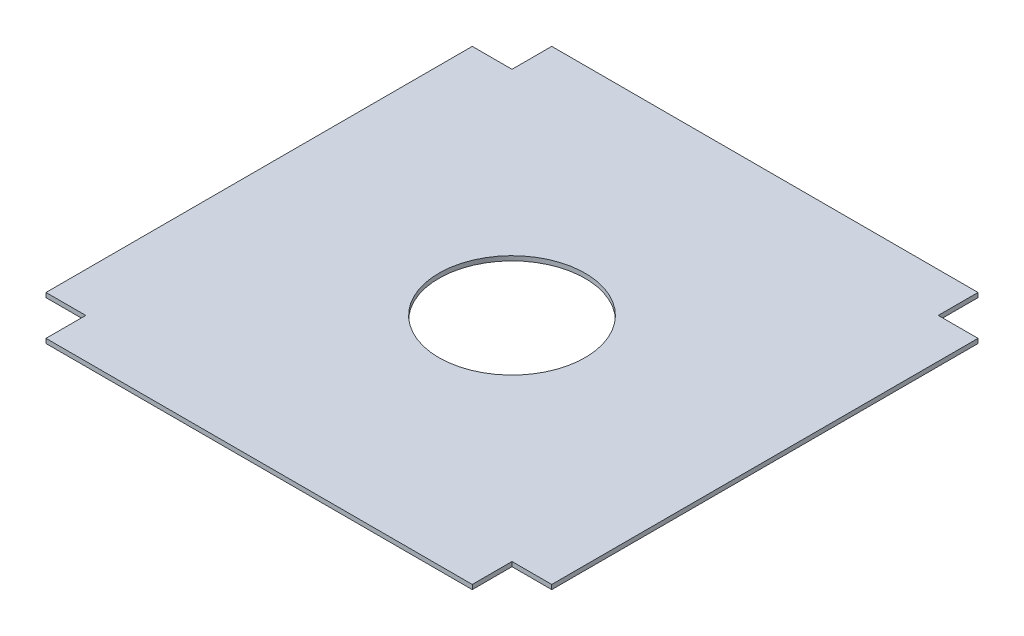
from build123d import *

# Parameters (mm, degrees)
SKETCH2_R           = 51.435
BOSS_EXTRUDE2_DEPTH = 3.175


with BuildPart() as part:
    # Sketch2 → Boss-Extrude2 (new body)
    with BuildSketch(Plane(origin=(0, 0, 0), x_dir=(1, 0, 0), z_dir=(0, 1, 0))):
        Polygon((149.86, 177.8), (-149.86, 177.8), (-149.86, 149.86), (-177.8, 149.86), (-177.8, -149.86), (-149.86, -149.86), (-149.86, -177.8), (149.86, -177.8), (149.86, -149.86), (177.8, -149.86), (177.8, 149.86), (149.86, 149.86), align=None)
        with Locations(Location((0, 0, 0), (0, 0, 270))):
            Circle(SKETCH2_R, mode=Mode.SUBTRACT)
    extrude(amount=BOSS_EXTRUDE2_DEPTH)


solid = part.part
